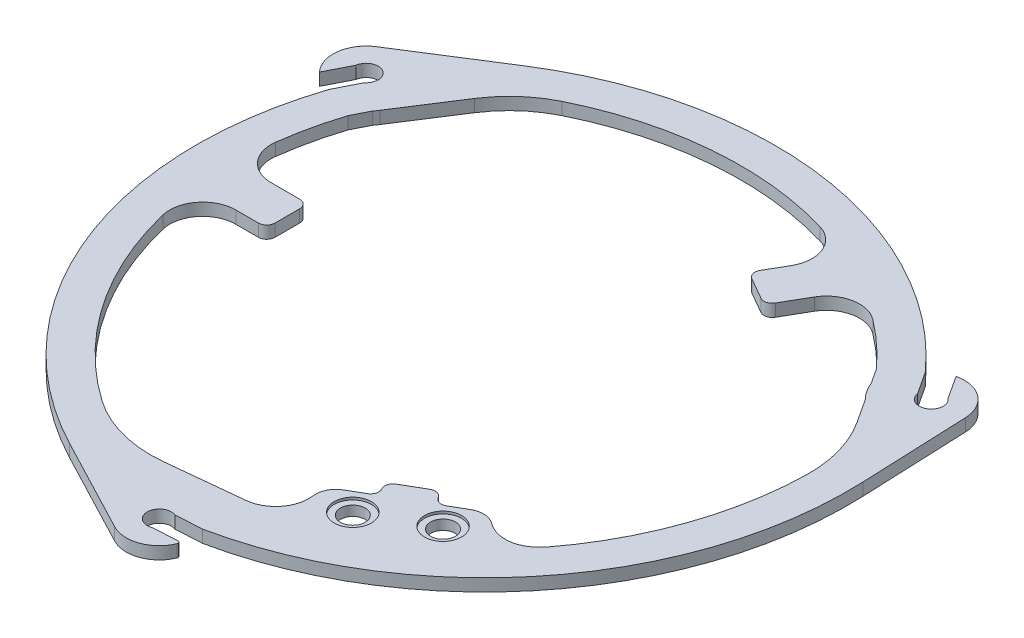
from build123d import *

# Parameters (mm, degrees)
BOSS_EXTRUDE1_DEPTH                     = 1.5
CUT_EXTRUDE1_DEPTH                      = 59.292971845
SKETCH3_W                               = 1.45
SKETCH3_H                               = 1.5
SKETCH4_W                               = 1.45
SKETCH4_H                               = 1.5
SKETCH5_W                               = 1.45
SKETCH5_H                               = 1.5
CBORE_FOR_M5_HEX_HEAD_BOLT1_D           = 3
CBORE_FOR_M5_HEX_HEAD_BOLT1_CBORE_D     = 4.5
CBORE_FOR_M5_HEX_HEAD_BOLT1_CBORE_DEPTH = 0.3
FILLET1_R                               = 2.5
FILLET2_R                               = 14
FILLET3_R                               = 15
BOSS_EXTRUDE2_DEPTH                     = 1.5
FILLET4_R                               = 1
FILLET5_R                               = 4
CIRPATTERN1_COUNT                       = 2
CIRPATTERN1_ANGLE                       = 120
FILLET6_R                               = 4
FILLET7_R                               = 1


with BuildPart() as part:
    # Sketch1 → Boss-Extrude1 (new body)
    with BuildSketch(Plane.XZ):
        with BuildLine():
            Line((0.538105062, 40.846455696), (3.449013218, 40.690656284))
            ThreePointArc((3.449013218, 40.690656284), (3.666563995, 40.796053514), (3.69319973, 41.036318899))
            ThreePointArc((3.69319973, 41.036318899), (1.360461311, 43.261534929), (-1.856003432, 43.043338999))
            Line((-1.856003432, 43.043338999), (-13.373590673, 37.010418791))
            ThreePointArc((-13.373590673, 37.010418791), (-33.746288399, 14.534570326), (-34.731472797, -15.784400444))
            Line((-34.731472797, -15.784400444), (-33.295808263, -18.622879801))
            ThreePointArc((-33.295808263, -18.622879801), (-34.924574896, -18.489434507), (-35.643120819, -19.957215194))
            Line((-35.643120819, -19.957215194), (-37.134167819, -17.02281059))
            ThreePointArc((-37.134167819, -17.02281059), (-38.175308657, -20.260381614), (-36.348623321, -23.129015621))
            Line((-36.348623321, -23.129015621), (-25.365167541, -30.087078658))
            ThreePointArc((-25.365167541, -30.087078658), (4.285837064, -36.4924282), (31.035428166, -22.186137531))
            Line((31.035428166, -22.186137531), (32.775791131, -19.523575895))
            ThreePointArc((32.775791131, -19.523575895), (33.474607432, -21.000851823), (35.105015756, -20.889240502))
            Line((35.105015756, -20.889240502), (33.309270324, -23.647727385))
            ThreePointArc((33.309270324, -23.647727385), (36.633659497, -22.930596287), (38.204626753, -19.914323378))
            Line((38.204626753, -19.914323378), (38.738758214, -6.923340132))
            ThreePointArc((38.738758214, -6.923340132), (29.460451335, 21.957857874), (3.696044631, 37.970537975))
            Line((3.696044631, 37.970537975), (0.520017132, 38.146455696))
            ThreePointArc((0.520017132, 38.146455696), (1.449967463, 39.490286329), (0.538105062, 40.846455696))
        make_face()
    extrude(amount=-BOSS_EXTRUDE1_DEPTH)

    # Sketch2 → Cut-Extrude1 (cut, through all)
    with BuildSketch(Plane(origin=(0, 1.5, 0), x_dir=(-1, 0, 0), z_dir=(0, 1, 0))):
        with BuildLine():
            Line((10.498143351, 33.759978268), (-3.345437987, 32.327357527))
            ThreePointArc((-3.345437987, 32.327357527), (-6.500224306, 30.159640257), (-6.38903093, 26.333505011))
            Line((-6.38903093, 26.333505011), (-9.968910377, 24.266660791))
            ThreePointArc((-9.968910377, 24.266660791), (-10.434836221, 23.659454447), (-10.334935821, 22.900635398))
            ThreePointArc((-10.334935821, 22.900635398), (-10.235035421, 22.14181635), (-10.700961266, 21.534610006))
            Line((-10.700961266, 21.534610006), (-13.299037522, 20.034610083))
            ThreePointArc((-13.299037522, 20.034610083), (-14.05785657, 19.934709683), (-14.665062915, 20.400635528))
            ThreePointArc((-14.665062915, 20.400635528), (-15.27226926, 20.866561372), (-16.031088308, 20.766660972))
            Line((-16.031088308, 20.766660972), (-19.610969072, 18.699815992))
            ThreePointArc((-19.610969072, 18.699815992), (-22.868902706, 20.70917952), (-26.323593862, 19.060913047))
            Line((-26.323593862, 19.060913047), (-26.406716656, 19.04061486))
            ThreePointArc((-26.406716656, 19.04061486), (-33.118374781, 5.556366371), (-34.338500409, -9.456381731))
            Line((-34.338500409, -9.456381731), (-30.23769909, -15.730151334))
            ThreePointArc((-30.23769909, -15.730151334), (-29.478683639, -16.658716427), (-28.932757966, -17.726566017))
            Line((-28.932757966, -17.726566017), (-27.695446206, -19.619515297))
            ThreePointArc((-27.695446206, -19.619515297), (-3.551979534, -32.353925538), (23.117485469, -26.539132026))
            Line((23.117485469, -26.539132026), (29.457389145, -16.691542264))
            ThreePointArc((29.457389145, -16.691542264), (29.630925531, -16.437469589), (29.818035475, -16.193220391))
            Line((29.818035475, -16.193220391), (30.83872176, -14.175202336))
            ThreePointArc((30.83872176, -14.175202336), (29.595487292, 13.580450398), (10.498143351, 33.759978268))
        make_face()
    extrude(amount=-CUT_EXTRUDE1_DEPTH, mode=Mode.SUBTRACT)

    # Sketch3 → Cut-Revolve1 (revolve, cut)
    with BuildSketch(Plane.XY.offset(-19.75)):
        with Locations((-33.483003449, 0.75)):
            Rectangle(SKETCH3_W, SKETCH3_H)
    revolve(axis=Axis((-34.208003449, 1.5, -19.75), (0, -1, 0)), mode=Mode.SUBTRACT)

    # Sketch4 → Cut-Revolve2 (revolve, cut)
    with BuildSketch(Plane.XY.offset(39.5)):
        with Locations((0.725, 0.75)):
            Rectangle(SKETCH4_W, SKETCH4_H)
    revolve(axis=Axis((0, 1.5, 39.5), (0, -1, 0)), mode=Mode.SUBTRACT)

    # Sketch5 → Cut-Revolve3 (revolve, cut)
    with BuildSketch(Plane(origin=(0, 0, -19.75), x_dir=(-1, 0, 0), z_dir=(0, 0, -1))):
        with Locations((-34.933003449, 0.75)):
            Rectangle(SKETCH5_W, SKETCH5_H)
    revolve(axis=Axis((34.208003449, 0, -19.75), (0, 1, 0)), mode=Mode.SUBTRACT)

    # CBORE for M5 Hex Head Bolt1 (through all)
    with Locations(Plane(origin=(0, 1.5, 0), x_dir=(1, 0, 0), z_dir=(0, 1, 0))):
        with Locations((17.964100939, -23.114737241), (11.03589759, -27.114737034)):
            CounterBoreHole(CBORE_FOR_M5_HEX_HEAD_BOLT1_D / 2, CBORE_FOR_M5_HEX_HEAD_BOLT1_CBORE_D / 2, CBORE_FOR_M5_HEX_HEAD_BOLT1_CBORE_DEPTH)

    # Fillet1
    fillet1_edges = [part.edges().sort_by_distance(p)[0] for p in [
        (19.610969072, 0.75, 18.699815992),
        (6.38903093, 0.75, 26.333505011),
    ]]
    fillet(fillet1_edges, radius=FILLET1_R)

    # Fillet2
    fillet2_edges = [part.edges().sort_by_distance(p)[0] for p in [
        (-23.117485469, 0.75, -26.539132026),
    ]]
    fillet(fillet2_edges, radius=FILLET2_R)

    # Fillet3
    fillet3_edges = [part.edges().sort_by_distance(p)[0] for p in [
        (-10.498143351, 0.75, 33.759978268),
        (34.338500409, 0.75, -9.456381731),
    ]]
    fillet(fillet3_edges, radius=FILLET3_R)

    # Sketch8 → Boss-Extrude2 (add)
    with BuildSketch(Plane(origin=(0, 1.5, 0), x_dir=(-1, 0, 0), z_dir=(0, 1, 0))):
        Polygon((-14.834937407, -30.694863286), (-9.834937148, -22.034609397), (-14.165064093, -19.534609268), (-19.165064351, -28.194863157), align=None)
    boss_extrude2 = extrude(amount=-BOSS_EXTRUDE2_DEPTH)

    # Fillet4
    fillet4_edges = [part.edges().sort_by_distance(p)[0] for p in [
        (9.834937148, 0.75, -22.034609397),
        (14.165064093, 0.75, -19.534609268),
    ]]
    fillet(fillet4_edges, radius=FILLET4_R)

    # Fillet5
    fillet5_edges = [part.edges().sort_by_distance(p)[0] for p in [
        (18.542051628, 0.75, -27.115773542),
        (14.088015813, 0.75, -29.401157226),
    ]]
    fillet(fillet5_edges, radius=FILLET5_R)

    # CirPattern1: Boss-Extrude2 ×2 about axis
    cirpattern1_axis = Axis((0, 0, 0), (0, 1, 0))
    for i in range(1, CIRPATTERN1_COUNT):
        add(boss_extrude2.rotate(cirpattern1_axis, i * CIRPATTERN1_ANGLE / (CIRPATTERN1_COUNT - 1)))

    # Fillet6
    fillet6_edges = [part.edges().sort_by_distance(p)[0] for p in [
        (-32.753974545, 0.75, -2.500000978),
        (-32.506156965, 0.75, 2.49999903),
    ]]
    fillet(fillet6_edges, radius=FILLET6_R)

    # Fillet7
    fillet7_edges = [part.edges().sort_by_distance(p)[0] for p in [
        (-24.000000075, 0.75, 2.499999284),
        (-23.999999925, 0.75, -2.500000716),
    ]]
    fillet(fillet7_edges, radius=FILLET7_R)


solid = part.part
